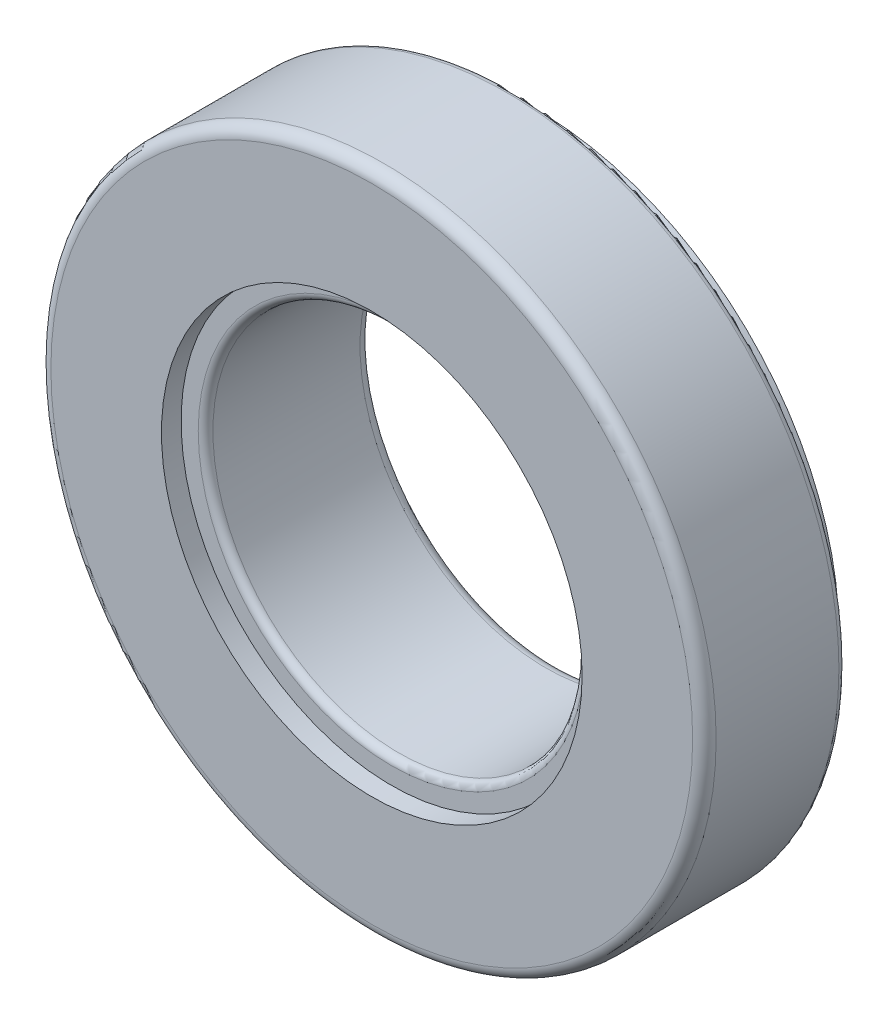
ISO-10303-21;
HEADER;
FILE_DESCRIPTION(('STEP AP214'),'2;1');
FILE_NAME('part.step','',(''),(''),'','','');
FILE_SCHEMA(('AUTOMOTIVE_DESIGN { 1 0 10303 214 1 1 1 1 }'));
ENDSEC;
DATA;
#1=APPLICATION_CONTEXT('core data for automotive mechanical design processes');
#2=APPLICATION_PROTOCOL_DEFINITION('international standard','automotive_design',2000,#1);
#3=PRODUCT_CONTEXT('',#1,'mechanical');
#4=PRODUCT('Part','Part','',(#3));
#5=PRODUCT_RELATED_PRODUCT_CATEGORY('part','',(#4));
#6=PRODUCT_DEFINITION_FORMATION('','',#4);
#7=PRODUCT_DEFINITION_CONTEXT('part definition',#1,'design');
#8=PRODUCT_DEFINITION('design','',#6,#7);
#9=PRODUCT_DEFINITION_SHAPE('','',#8);
#10=(LENGTH_UNIT() NAMED_UNIT(*) SI_UNIT(.MILLI.,.METRE.));
#11=(NAMED_UNIT(*) PLANE_ANGLE_UNIT() SI_UNIT($,.RADIAN.));
#12=(NAMED_UNIT(*) SI_UNIT($,.STERADIAN.) SOLID_ANGLE_UNIT());
#13=UNCERTAINTY_MEASURE_WITH_UNIT(LENGTH_MEASURE(1.E-05),#10,'distance_accuracy_value','');
#14=(GEOMETRIC_REPRESENTATION_CONTEXT(3) GLOBAL_UNCERTAINTY_ASSIGNED_CONTEXT((#13)) GLOBAL_UNIT_ASSIGNED_CONTEXT((#10,
#11,#12)) REPRESENTATION_CONTEXT('',''));
#15=CARTESIAN_POINT('',(0.,0.,0.));
#16=DIRECTION('',(0.,0.,1.));
#17=DIRECTION('',(1.,0.,0.));
#18=AXIS2_PLACEMENT_3D('',#15,#16,#17);
#19=CARTESIAN_POINT('',(0.,0.,59.9913216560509));
#20=DIRECTION('',(0.,0.,1.));
#21=DIRECTION('',(1.,0.,0.));
#22=AXIS2_PLACEMENT_3D('',#19,#20,#21);
#23=CYLINDRICAL_SURFACE('',#22,27.1);
#24=CARTESIAN_POINT('',(0.,0.,-16.75));
#25=DIRECTION('',(0.,0.,1.));
#26=DIRECTION('',(1.,0.,0.));
#27=AXIS2_PLACEMENT_3D('',#24,#25,#26);
#28=CIRCLE('',#27,27.1);
#29=CARTESIAN_POINT('',(27.1,0.,-16.75));
#30=VERTEX_POINT('',#29);
#31=EDGE_CURVE('E10',#30,#30,#28,.T.);
#32=ORIENTED_EDGE('',*,*,#31,.F.);
#33=EDGE_LOOP('',(#32));
#34=FACE_BOUND('',#33,.T.);
#35=CARTESIAN_POINT('',(0.,0.,-19.));
#36=DIRECTION('',(0.,0.,1.));
#37=DIRECTION('',(1.,0.,0.));
#38=AXIS2_PLACEMENT_3D('',#35,#36,#37);
#39=CIRCLE('',#38,27.1);
#40=CARTESIAN_POINT('',(27.1,0.,-19.));
#41=VERTEX_POINT('',#40);
#42=EDGE_CURVE('E77',#41,#41,#39,.T.);
#43=ORIENTED_EDGE('',*,*,#42,.T.);
#44=EDGE_LOOP('',(#43));
#45=FACE_BOUND('',#44,.T.);
#46=ADVANCED_FACE('F31',(#34,#45),#23,.T.);
#47=CARTESIAN_POINT('',(0.,27.1,-16.75));
#48=DIRECTION('',(0.,0.,1.));
#49=DIRECTION('',(1.,0.,0.));
#50=AXIS2_PLACEMENT_3D('',#47,#48,#49);
#51=PLANE('',#50);
#52=CARTESIAN_POINT('',(0.,0.,-16.75));
#53=DIRECTION('',(0.,0.,1.));
#54=DIRECTION('',(1.,0.,0.));
#55=AXIS2_PLACEMENT_3D('',#52,#53,#54);
#56=CIRCLE('',#55,31.);
#57=CARTESIAN_POINT('',(31.,0.,-16.75));
#58=VERTEX_POINT('',#57);
#59=EDGE_CURVE('E37',#58,#58,#56,.T.);
#60=ORIENTED_EDGE('',*,*,#59,.F.);
#61=EDGE_LOOP('',(#60));
#62=FACE_BOUND('',#61,.T.);
#63=ORIENTED_EDGE('',*,*,#31,.T.);
#64=EDGE_LOOP('',(#63));
#65=FACE_BOUND('',#64,.T.);
#66=ADVANCED_FACE('F194',(#62,#65),#51,.F.);
#67=CARTESIAN_POINT('',(0.,0.,-16.75));
#68=DIRECTION('',(0.,0.,-1.));
#69=DIRECTION('',(-1.,0.,0.));
#70=AXIS2_PLACEMENT_3D('',#67,#68,#69);
#71=CONICAL_SURFACE('',#70,31.,0.131315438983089);
#72=CARTESIAN_POINT('',(0.,0.,-14.5));
#73=DIRECTION('',(0.,0.,1.));
#74=DIRECTION('',(1.,0.,0.));
#75=AXIS2_PLACEMENT_3D('',#72,#73,#74);
#76=CIRCLE('',#75,30.7028301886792);
#77=CARTESIAN_POINT('',(30.7028301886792,0.,-14.5));
#78=VERTEX_POINT('',#77);
#79=EDGE_CURVE('E41',#78,#78,#76,.T.);
#80=ORIENTED_EDGE('',*,*,#79,.F.);
#81=EDGE_LOOP('',(#80));
#82=FACE_BOUND('',#81,.T.);
#83=ORIENTED_EDGE('',*,*,#59,.T.);
#84=EDGE_LOOP('',(#83));
#85=FACE_BOUND('',#84,.T.);
#86=ADVANCED_FACE('F191',(#82,#85),#71,.T.);
#87=CARTESIAN_POINT('',(0.,30.7028301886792,-14.5));
#88=DIRECTION('',(0.,0.,1.));
#89=DIRECTION('',(1.,0.,0.));
#90=AXIS2_PLACEMENT_3D('',#87,#88,#89);
#91=PLANE('',#90);
#92=CARTESIAN_POINT('',(0.,0.,-14.5));
#93=DIRECTION('',(0.,0.,1.));
#94=DIRECTION('',(1.,0.,0.));
#95=AXIS2_PLACEMENT_3D('',#92,#93,#94);
#96=CIRCLE('',#95,33.25);
#97=CARTESIAN_POINT('',(33.25,0.,-14.5));
#98=VERTEX_POINT('',#97);
#99=EDGE_CURVE('E45',#98,#98,#96,.T.);
#100=ORIENTED_EDGE('',*,*,#99,.F.);
#101=EDGE_LOOP('',(#100));
#102=FACE_BOUND('',#101,.T.);
#103=ORIENTED_EDGE('',*,*,#79,.T.);
#104=EDGE_LOOP('',(#103));
#105=FACE_BOUND('',#104,.T.);
#106=ADVANCED_FACE('F187',(#102,#105),#91,.F.);
#107=CARTESIAN_POINT('',(0.,0.,-13.75));
#108=DIRECTION('',(0.,0.,1.));
#109=DIRECTION('',(1.,0.,0.));
#110=AXIS2_PLACEMENT_3D('',#107,#108,#109);
#111=TOROIDAL_SURFACE('',#110,33.25,0.750000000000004);
#112=CARTESIAN_POINT('',(0.,0.,-13.75));
#113=DIRECTION('',(0.,0.,1.));
#114=DIRECTION('',(1.,0.,0.));
#115=AXIS2_PLACEMENT_3D('',#112,#113,#114);
#116=CIRCLE('',#115,34.);
#117=CARTESIAN_POINT('',(34.,0.,-13.75));
#118=VERTEX_POINT('',#117);
#119=EDGE_CURVE('E50',#118,#118,#116,.T.);
#120=ORIENTED_EDGE('',*,*,#119,.F.);
#121=EDGE_LOOP('',(#120));
#122=FACE_BOUND('',#121,.T.);
#123=ORIENTED_EDGE('',*,*,#99,.T.);
#124=EDGE_LOOP('',(#123));
#125=FACE_BOUND('',#124,.T.);
#126=ADVANCED_FACE('F183',(#122,#125),#111,.T.);
#127=CARTESIAN_POINT('',(0.,0.,59.9913216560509));
#128=DIRECTION('',(0.,0.,1.));
#129=DIRECTION('',(1.,0.,0.));
#130=AXIS2_PLACEMENT_3D('',#127,#128,#129);
#131=CYLINDRICAL_SURFACE('',#130,34.);
#132=ORIENTED_EDGE('',*,*,#119,.T.);
#133=EDGE_LOOP('',(#132));
#134=FACE_BOUND('',#133,.T.);
#135=CARTESIAN_POINT('',(0.,0.,-1.2));
#136=DIRECTION('',(0.,0.,1.));
#137=DIRECTION('',(1.,0.,0.));
#138=AXIS2_PLACEMENT_3D('',#135,#136,#137);
#139=CIRCLE('',#138,34.);
#140=CARTESIAN_POINT('',(34.,0.,-1.2));
#141=VERTEX_POINT('',#140);
#142=EDGE_CURVE('E53',#141,#141,#139,.T.);
#143=ORIENTED_EDGE('',*,*,#142,.F.);
#144=EDGE_LOOP('',(#143));
#145=FACE_BOUND('',#144,.T.);
#146=ADVANCED_FACE('F179',(#134,#145),#131,.T.);
#147=CARTESIAN_POINT('',(0.,0.,-1.2));
#148=DIRECTION('',(0.,0.,1.));
#149=DIRECTION('',(1.,0.,0.));
#150=AXIS2_PLACEMENT_3D('',#147,#148,#149);
#151=TOROIDAL_SURFACE('',#150,32.8,1.2);
#152=CARTESIAN_POINT('',(0.,0.,0.));
#153=DIRECTION('',(0.,0.,1.));
#154=DIRECTION('',(1.,0.,0.));
#155=AXIS2_PLACEMENT_3D('',#152,#153,#154);
#156=CIRCLE('',#155,32.8);
#157=CARTESIAN_POINT('',(32.8,0.,0.));
#158=VERTEX_POINT('',#157);
#159=EDGE_CURVE('E56',#158,#158,#156,.T.);
#160=ORIENTED_EDGE('',*,*,#159,.F.);
#161=EDGE_LOOP('',(#160));
#162=FACE_BOUND('',#161,.T.);
#163=ORIENTED_EDGE('',*,*,#142,.T.);
#164=EDGE_LOOP('',(#163));
#165=FACE_BOUND('',#164,.T.);
#166=ADVANCED_FACE('F175',(#162,#165),#151,.T.);
#167=CARTESIAN_POINT('',(0.,21.5,0.));
#168=DIRECTION('',(0.,0.,1.));
#169=DIRECTION('',(1.,0.,0.));
#170=AXIS2_PLACEMENT_3D('',#167,#168,#169);
#171=PLANE('',#170);
#172=ORIENTED_EDGE('',*,*,#159,.T.);
#173=EDGE_LOOP('',(#172));
#174=FACE_BOUND('',#173,.T.);
#175=CARTESIAN_POINT('',(0.,0.,0.));
#176=DIRECTION('',(0.,0.,1.));
#177=DIRECTION('',(1.,0.,0.));
#178=AXIS2_PLACEMENT_3D('',#175,#176,#177);
#179=CIRCLE('',#178,21.5);
#180=CARTESIAN_POINT('',(21.5,0.,0.));
#181=VERTEX_POINT('',#180);
#182=EDGE_CURVE('E59',#181,#181,#179,.T.);
#183=ORIENTED_EDGE('',*,*,#182,.F.);
#184=EDGE_LOOP('',(#183));
#185=FACE_BOUND('',#184,.T.);
#186=ADVANCED_FACE('F171',(#174,#185),#171,.T.);
#187=CARTESIAN_POINT('',(0.,0.,59.9913216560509));
#188=DIRECTION('',(0.,0.,1.));
#189=DIRECTION('',(1.,0.,0.));
#190=AXIS2_PLACEMENT_3D('',#187,#188,#189);
#191=CYLINDRICAL_SURFACE('',#190,21.5);
#192=ORIENTED_EDGE('',*,*,#182,.T.);
#193=EDGE_LOOP('',(#192));
#194=FACE_BOUND('',#193,.T.);
#195=CARTESIAN_POINT('',(0.,0.,-2.01));
#196=DIRECTION('',(0.,0.,1.));
#197=DIRECTION('',(1.,0.,0.));
#198=AXIS2_PLACEMENT_3D('',#195,#196,#197);
#199=CIRCLE('',#198,21.5);
#200=CARTESIAN_POINT('',(21.5,0.,-2.01));
#201=VERTEX_POINT('',#200);
#202=EDGE_CURVE('E62',#201,#201,#199,.T.);
#203=ORIENTED_EDGE('',*,*,#202,.F.);
#204=EDGE_LOOP('',(#203));
#205=FACE_BOUND('',#204,.T.);
#206=ADVANCED_FACE('F167',(#194,#205),#191,.F.);
#207=CARTESIAN_POINT('',(0.,19.75,-2.01));
#208=DIRECTION('',(0.,0.,1.));
#209=DIRECTION('',(1.,0.,0.));
#210=AXIS2_PLACEMENT_3D('',#207,#208,#209);
#211=PLANE('',#210);
#212=ORIENTED_EDGE('',*,*,#202,.T.);
#213=EDGE_LOOP('',(#212));
#214=FACE_BOUND('',#213,.T.);
#215=CARTESIAN_POINT('',(0.,0.,-2.01));
#216=DIRECTION('',(0.,0.,1.));
#217=DIRECTION('',(1.,0.,0.));
#218=AXIS2_PLACEMENT_3D('',#215,#216,#217);
#219=CIRCLE('',#218,19.75);
#220=CARTESIAN_POINT('',(19.75,0.,-2.01));
#221=VERTEX_POINT('',#220);
#222=EDGE_CURVE('E65',#221,#221,#219,.T.);
#223=ORIENTED_EDGE('',*,*,#222,.F.);
#224=EDGE_LOOP('',(#223));
#225=FACE_BOUND('',#224,.T.);
#226=ADVANCED_FACE('F163',(#214,#225),#211,.T.);
#227=CARTESIAN_POINT('',(0.,0.,-2.76));
#228=DIRECTION('',(0.,0.,1.));
#229=DIRECTION('',(1.,0.,0.));
#230=AXIS2_PLACEMENT_3D('',#227,#228,#229);
#231=TOROIDAL_SURFACE('',#230,19.75,0.75);
#232=CARTESIAN_POINT('',(0.,0.,-2.76));
#233=DIRECTION('',(0.,0.,1.));
#234=DIRECTION('',(1.,0.,0.));
#235=AXIS2_PLACEMENT_3D('',#232,#233,#234);
#236=CIRCLE('',#235,19.);
#237=CARTESIAN_POINT('',(19.,0.,-2.76));
#238=VERTEX_POINT('',#237);
#239=EDGE_CURVE('E68',#238,#238,#236,.T.);
#240=ORIENTED_EDGE('',*,*,#239,.F.);
#241=EDGE_LOOP('',(#240));
#242=FACE_BOUND('',#241,.T.);
#243=ORIENTED_EDGE('',*,*,#222,.T.);
#244=EDGE_LOOP('',(#243));
#245=FACE_BOUND('',#244,.T.);
#246=ADVANCED_FACE('F159',(#242,#245),#231,.T.);
#247=CARTESIAN_POINT('',(0.,0.,59.9913216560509));
#248=DIRECTION('',(0.,0.,1.));
#249=DIRECTION('',(1.,0.,0.));
#250=AXIS2_PLACEMENT_3D('',#247,#248,#249);
#251=CYLINDRICAL_SURFACE('',#250,19.);
#252=CARTESIAN_POINT('',(0.,0.,-17.8));
#253=DIRECTION('',(0.,0.,1.));
#254=DIRECTION('',(1.,0.,0.));
#255=AXIS2_PLACEMENT_3D('',#252,#253,#254);
#256=CIRCLE('',#255,19.);
#257=CARTESIAN_POINT('',(19.,0.,-17.8));
#258=VERTEX_POINT('',#257);
#259=EDGE_CURVE('E71',#258,#258,#256,.T.);
#260=ORIENTED_EDGE('',*,*,#259,.F.);
#261=EDGE_LOOP('',(#260));
#262=FACE_BOUND('',#261,.T.);
#263=ORIENTED_EDGE('',*,*,#239,.T.);
#264=EDGE_LOOP('',(#263));
#265=FACE_BOUND('',#264,.T.);
#266=ADVANCED_FACE('F155',(#262,#265),#251,.F.);
#267=CARTESIAN_POINT('',(0.,0.,-17.8));
#268=DIRECTION('',(0.,0.,1.));
#269=DIRECTION('',(1.,0.,0.));
#270=AXIS2_PLACEMENT_3D('',#267,#268,#269);
#271=TOROIDAL_SURFACE('',#270,20.2,1.2);
#272=ORIENTED_EDGE('',*,*,#259,.T.);
#273=EDGE_LOOP('',(#272));
#274=FACE_BOUND('',#273,.T.);
#275=CARTESIAN_POINT('',(0.,0.,-19.));
#276=DIRECTION('',(0.,0.,1.));
#277=DIRECTION('',(1.,0.,0.));
#278=AXIS2_PLACEMENT_3D('',#275,#276,#277);
#279=CIRCLE('',#278,20.2);
#280=CARTESIAN_POINT('',(20.2,0.,-19.));
#281=VERTEX_POINT('',#280);
#282=EDGE_CURVE('E74',#281,#281,#279,.T.);
#283=ORIENTED_EDGE('',*,*,#282,.F.);
#284=EDGE_LOOP('',(#283));
#285=FACE_BOUND('',#284,.T.);
#286=ADVANCED_FACE('F151',(#274,#285),#271,.T.);
#287=CARTESIAN_POINT('',(0.,20.2,-19.));
#288=DIRECTION('',(0.,0.,1.));
#289=DIRECTION('',(1.,0.,0.));
#290=AXIS2_PLACEMENT_3D('',#287,#288,#289);
#291=PLANE('',#290);
#292=ORIENTED_EDGE('',*,*,#42,.F.);
#293=EDGE_LOOP('',(#292));
#294=FACE_BOUND('',#293,.T.);
#295=ORIENTED_EDGE('',*,*,#282,.T.);
#296=EDGE_LOOP('',(#295));
#297=FACE_BOUND('',#296,.T.);
#298=ADVANCED_FACE('F149',(#294,#297),#291,.F.);
#299=CLOSED_SHELL('',(#46,#66,#86,#106,#126,#146,#166,#186,#206,#226,#246,#266,#286,#298));
#300=CARTESIAN_POINT('',(0.,0.,-14.4841906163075));
#301=DIRECTION('',(0.,0.,1.));
#302=DIRECTION('',(1.,0.,0.));
#303=AXIS2_PLACEMENT_3D('',#300,#301,#302);
#304=CONICAL_SURFACE('',#303,30.7057855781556,1.43948088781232);
#305=CARTESIAN_POINT('',(0.,0.,-14.4855));
#306=DIRECTION('',(0.,0.,1.));
#307=DIRECTION('',(1.,0.,0.));
#308=AXIS2_PLACEMENT_3D('',#305,#306,#307);
#309=CIRCLE('',#308,30.6958716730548);
#310=CARTESIAN_POINT('',(30.6958716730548,0.,-14.4855));
#311=VERTEX_POINT('',#310);
#312=EDGE_CURVE('E89',#311,#311,#309,.T.);
#313=ORIENTED_EDGE('',*,*,#312,.F.);
#314=EDGE_LOOP('',(#313));
#315=FACE_BOUND('',#314,.T.);
#316=CARTESIAN_POINT('',(0.,0.,-14.4841906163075));
#317=DIRECTION('',(0.,0.,1.));
#318=DIRECTION('',(1.,0.,0.));
#319=AXIS2_PLACEMENT_3D('',#316,#317,#318);
#320=CIRCLE('',#319,30.7057855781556);
#321=CARTESIAN_POINT('',(30.7057855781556,0.,-14.4841906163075));
#322=VERTEX_POINT('',#321);
#323=EDGE_CURVE('E80',#322,#322,#320,.T.);
#324=ORIENTED_EDGE('',*,*,#323,.T.);
#325=EDGE_LOOP('',(#324));
#326=FACE_BOUND('',#325,.T.);
#327=ADVANCED_FACE('F133',(#315,#326),#304,.F.);
#328=CARTESIAN_POINT('',(0.,0.,-0.0145000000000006));
#329=DIRECTION('',(0.,0.,-1.));
#330=DIRECTION('',(-1.,0.,0.));
#331=AXIS2_PLACEMENT_3D('',#328,#329,#330);
#332=CONICAL_SURFACE('',#331,28.794694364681,0.131315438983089);
#333=ORIENTED_EDGE('',*,*,#323,.F.);
#334=EDGE_LOOP('',(#333));
#335=FACE_BOUND('',#334,.T.);
#336=CARTESIAN_POINT('',(0.,0.,-0.0145000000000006));
#337=DIRECTION('',(0.,0.,1.));
#338=DIRECTION('',(1.,0.,0.));
#339=AXIS2_PLACEMENT_3D('',#336,#337,#338);
#340=CIRCLE('',#339,28.794694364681);
#341=CARTESIAN_POINT('',(28.794694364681,0.,-0.0145000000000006));
#342=VERTEX_POINT('',#341);
#343=EDGE_CURVE('E83',#342,#342,#340,.T.);
#344=ORIENTED_EDGE('',*,*,#343,.T.);
#345=EDGE_LOOP('',(#344));
#346=FACE_BOUND('',#345,.T.);
#347=ADVANCED_FACE('F135',(#335,#346),#332,.F.);
#348=CARTESIAN_POINT('',(0.,0.,-0.0158093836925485));
#349=DIRECTION('',(0.,0.,1.));
#350=DIRECTION('',(1.,0.,0.));
#351=AXIS2_PLACEMENT_3D('',#348,#349,#350);
#352=CONICAL_SURFACE('',#351,28.7847804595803,1.43948088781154);
#353=ORIENTED_EDGE('',*,*,#343,.F.);
#354=EDGE_LOOP('',(#353));
#355=FACE_BOUND('',#354,.T.);
#356=CARTESIAN_POINT('',(0.,0.,-0.0158093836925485));
#357=DIRECTION('',(0.,0.,1.));
#358=DIRECTION('',(1.,0.,0.));
#359=AXIS2_PLACEMENT_3D('',#356,#357,#358);
#360=CIRCLE('',#359,28.7847804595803);
#361=CARTESIAN_POINT('',(28.7847804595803,0.,-0.0158093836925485));
#362=VERTEX_POINT('',#361);
#363=EDGE_CURVE('E86',#362,#362,#360,.T.);
#364=ORIENTED_EDGE('',*,*,#363,.T.);
#365=EDGE_LOOP('',(#364));
#366=FACE_BOUND('',#365,.T.);
#367=ADVANCED_FACE('F142',(#355,#366),#352,.T.);
#368=CARTESIAN_POINT('',(0.,0.,-0.0158093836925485));
#369=DIRECTION('',(0.,0.,-1.));
#370=DIRECTION('',(-1.,0.,0.));
#371=AXIS2_PLACEMENT_3D('',#368,#369,#370);
#372=CONICAL_SURFACE('',#371,28.7847804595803,0.131315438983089);
#373=ORIENTED_EDGE('',*,*,#312,.T.);
#374=EDGE_LOOP('',(#373));
#375=FACE_BOUND('',#374,.T.);
#376=ORIENTED_EDGE('',*,*,#363,.F.);
#377=EDGE_LOOP('',(#376));
#378=FACE_BOUND('',#377,.T.);
#379=ADVANCED_FACE('F304',(#375,#378),#372,.T.);
#380=CLOSED_SHELL('',(#327,#347,#367,#379));
#381=CARTESIAN_POINT('',(0.,0.,-5.90555470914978));
#382=DIRECTION('',(0.,0.,1.));
#383=DIRECTION('',(1.,0.,0.));
#384=AXIS2_PLACEMENT_3D('',#381,#382,#383);
#385=CONICAL_SURFACE('',#384,25.7952356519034,1.43948088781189);
#386=CARTESIAN_POINT('',(0.,0.,-5.90686409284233));
#387=DIRECTION('',(0.,0.,1.));
#388=DIRECTION('',(1.,0.,0.));
#389=AXIS2_PLACEMENT_3D('',#386,#387,#388);
#390=CIRCLE('',#389,25.7853217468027);
#391=CARTESIAN_POINT('',(25.7853217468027,0.,-5.90686409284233));
#392=VERTEX_POINT('',#391);
#393=EDGE_CURVE('E101',#392,#392,#390,.T.);
#394=ORIENTED_EDGE('',*,*,#393,.T.);
#395=EDGE_LOOP('',(#394));
#396=FACE_BOUND('',#395,.T.);
#397=CARTESIAN_POINT('',(0.,0.,-5.90555470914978));
#398=DIRECTION('',(0.,0.,1.));
#399=DIRECTION('',(1.,0.,0.));
#400=AXIS2_PLACEMENT_3D('',#397,#398,#399);
#401=CIRCLE('',#400,25.7952356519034);
#402=CARTESIAN_POINT('',(25.7952356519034,0.,-5.90555470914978));
#403=VERTEX_POINT('',#402);
#404=EDGE_CURVE('E92',#403,#403,#401,.T.);
#405=ORIENTED_EDGE('',*,*,#404,.F.);
#406=EDGE_LOOP('',(#405));
#407=FACE_BOUND('',#406,.T.);
#408=ADVANCED_FACE('F105',(#396,#407),#385,.T.);
#409=CARTESIAN_POINT('',(0.,0.,-13.0931359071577));
#410=DIRECTION('',(0.,0.,-1.));
#411=DIRECTION('',(-1.,0.,0.));
#412=AXIS2_PLACEMENT_3D('',#409,#410,#411);
#413=CONICAL_SURFACE('',#412,26.7445388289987,0.131315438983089);
#414=ORIENTED_EDGE('',*,*,#404,.T.);
#415=EDGE_LOOP('',(#414));
#416=FACE_BOUND('',#415,.T.);
#417=CARTESIAN_POINT('',(0.,0.,-13.0931359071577));
#418=DIRECTION('',(0.,0.,1.));
#419=DIRECTION('',(1.,0.,0.));
#420=AXIS2_PLACEMENT_3D('',#417,#418,#419);
#421=CIRCLE('',#420,26.7445388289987);
#422=CARTESIAN_POINT('',(26.7445388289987,0.,-13.0931359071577));
#423=VERTEX_POINT('',#422);
#424=EDGE_CURVE('E95',#423,#423,#421,.T.);
#425=ORIENTED_EDGE('',*,*,#424,.F.);
#426=EDGE_LOOP('',(#425));
#427=FACE_BOUND('',#426,.T.);
#428=ADVANCED_FACE('F119',(#416,#427),#413,.F.);
#429=CARTESIAN_POINT('',(0.,0.,-13.0931359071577));
#430=DIRECTION('',(0.,0.,1.));
#431=DIRECTION('',(1.,0.,0.));
#432=AXIS2_PLACEMENT_3D('',#429,#430,#431);
#433=CONICAL_SURFACE('',#432,26.7445388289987,1.43948088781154);
#434=CARTESIAN_POINT('',(0.,0.,-13.0944452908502));
#435=DIRECTION('',(0.,0.,1.));
#436=DIRECTION('',(1.,0.,0.));
#437=AXIS2_PLACEMENT_3D('',#434,#435,#436);
#438=CIRCLE('',#437,26.734624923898);
#439=CARTESIAN_POINT('',(26.734624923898,0.,-13.0944452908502));
#440=VERTEX_POINT('',#439);
#441=EDGE_CURVE('E98',#440,#440,#438,.T.);
#442=ORIENTED_EDGE('',*,*,#441,.F.);
#443=EDGE_LOOP('',(#442));
#444=FACE_BOUND('',#443,.T.);
#445=ORIENTED_EDGE('',*,*,#424,.T.);
#446=EDGE_LOOP('',(#445));
#447=FACE_BOUND('',#446,.T.);
#448=ADVANCED_FACE('F111',(#444,#447),#433,.F.);
#449=CARTESIAN_POINT('',(0.,0.,-13.0944452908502));
#450=DIRECTION('',(0.,0.,-1.));
#451=DIRECTION('',(-1.,0.,0.));
#452=AXIS2_PLACEMENT_3D('',#449,#450,#451);
#453=CONICAL_SURFACE('',#452,26.734624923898,0.131315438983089);
#454=ORIENTED_EDGE('',*,*,#393,.F.);
#455=EDGE_LOOP('',(#454));
#456=FACE_BOUND('',#455,.T.);
#457=ORIENTED_EDGE('',*,*,#441,.T.);
#458=EDGE_LOOP('',(#457));
#459=FACE_BOUND('',#458,.T.);
#460=ADVANCED_FACE('F108',(#456,#459),#453,.T.);
#461=CLOSED_SHELL('',(#408,#428,#448,#460));
#462=ORIENTED_CLOSED_SHELL('',*,#380,.T.);
#463=ORIENTED_CLOSED_SHELL('',*,#461,.T.);
#464=BREP_WITH_VOIDS('B2',#299,(#462,#463));
#465=ADVANCED_BREP_SHAPE_REPRESENTATION('',(#18,#464),#14);
#466=SHAPE_DEFINITION_REPRESENTATION(#9,#465);
ENDSEC;
END-ISO-10303-21;
